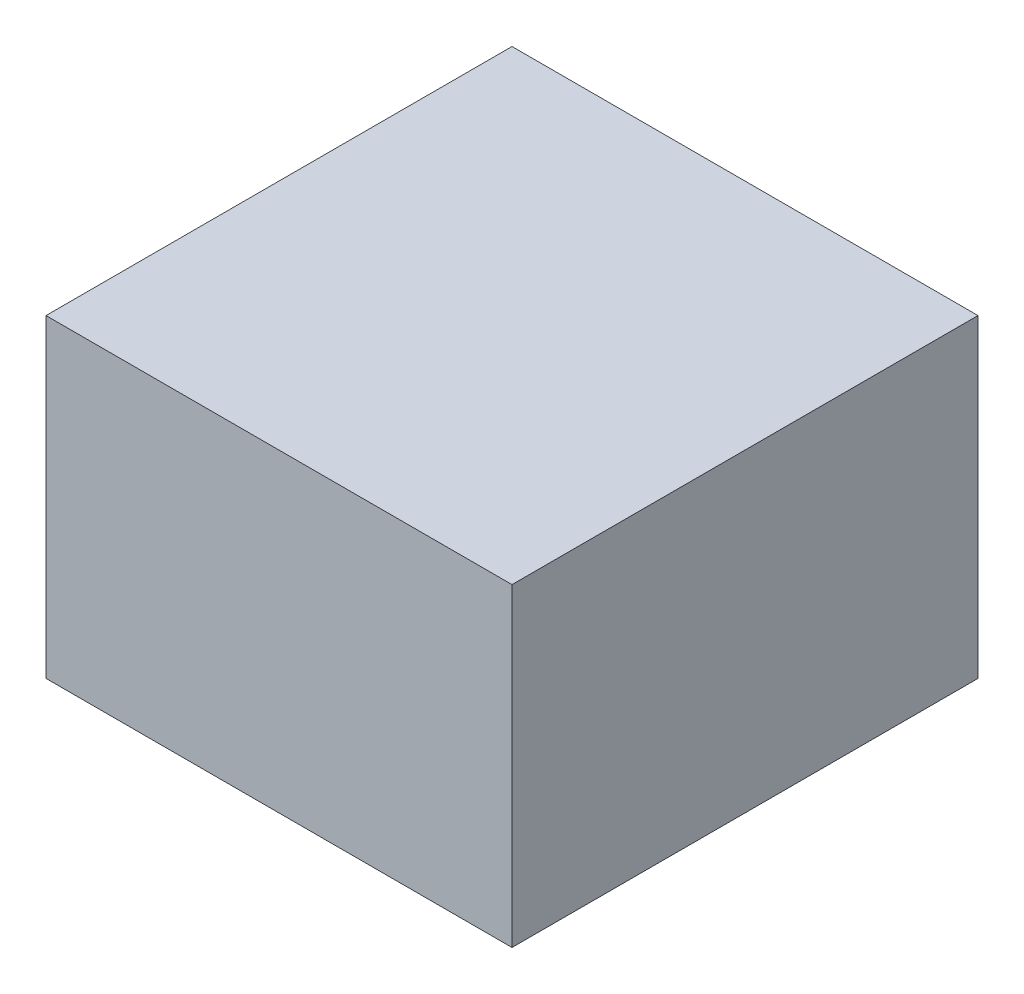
ISO-10303-21;
HEADER;
FILE_DESCRIPTION(('STEP AP214'),'2;1');
FILE_NAME('part.step','',(''),(''),'','','');
FILE_SCHEMA(('AUTOMOTIVE_DESIGN { 1 0 10303 214 1 1 1 1 }'));
ENDSEC;
DATA;
#1=APPLICATION_CONTEXT('core data for automotive mechanical design processes');
#2=APPLICATION_PROTOCOL_DEFINITION('international standard','automotive_design',2000,#1);
#3=PRODUCT_CONTEXT('',#1,'mechanical');
#4=PRODUCT('Part','Part','',(#3));
#5=PRODUCT_RELATED_PRODUCT_CATEGORY('part','',(#4));
#6=PRODUCT_DEFINITION_FORMATION('','',#4);
#7=PRODUCT_DEFINITION_CONTEXT('part definition',#1,'design');
#8=PRODUCT_DEFINITION('design','',#6,#7);
#9=PRODUCT_DEFINITION_SHAPE('','',#8);
#10=(LENGTH_UNIT() NAMED_UNIT(*) SI_UNIT(.MILLI.,.METRE.));
#11=(NAMED_UNIT(*) PLANE_ANGLE_UNIT() SI_UNIT($,.RADIAN.));
#12=(NAMED_UNIT(*) SI_UNIT($,.STERADIAN.) SOLID_ANGLE_UNIT());
#13=UNCERTAINTY_MEASURE_WITH_UNIT(LENGTH_MEASURE(1.E-05),#10,'distance_accuracy_value','');
#14=(GEOMETRIC_REPRESENTATION_CONTEXT(3) GLOBAL_UNCERTAINTY_ASSIGNED_CONTEXT((#13)) GLOBAL_UNIT_ASSIGNED_CONTEXT((#10,
#11,#12)) REPRESENTATION_CONTEXT('',''));
#15=CARTESIAN_POINT('',(0.,0.,0.));
#16=DIRECTION('',(0.,0.,1.));
#17=DIRECTION('',(1.,0.,0.));
#18=AXIS2_PLACEMENT_3D('',#15,#16,#17);
#19=CARTESIAN_POINT('',(0.,29.,0.));
#20=DIRECTION('',(1.,0.,0.));
#21=DIRECTION('',(0.,0.,-1.));
#22=AXIS2_PLACEMENT_3D('',#19,#20,#21);
#23=PLANE('',#22);
#24=DIRECTION('',(0.,0.,1.));
#25=VECTOR('',#24,1.);
#26=CARTESIAN_POINT('',(0.,0.,0.));
#27=LINE('',#26,#25);
#28=CARTESIAN_POINT('',(0.,0.,-43.));
#29=VERTEX_POINT('',#28);
#30=CARTESIAN_POINT('',(0.,0.,0.));
#31=VERTEX_POINT('',#30);
#32=EDGE_CURVE('E107',#29,#31,#27,.T.);
#33=ORIENTED_EDGE('',*,*,#32,.T.);
#34=DIRECTION('',(0.,-1.,0.));
#35=VECTOR('',#34,1.);
#36=CARTESIAN_POINT('',(0.,29.,0.));
#37=LINE('',#36,#35);
#38=CARTESIAN_POINT('',(0.,29.,0.));
#39=VERTEX_POINT('',#38);
#40=EDGE_CURVE('E11',#39,#31,#37,.T.);
#41=ORIENTED_EDGE('',*,*,#40,.F.);
#42=DIRECTION('',(0.,0.,1.));
#43=VECTOR('',#42,1.);
#44=CARTESIAN_POINT('',(0.,29.,0.));
#45=LINE('',#44,#43);
#46=CARTESIAN_POINT('',(0.,29.,-43.));
#47=VERTEX_POINT('',#46);
#48=EDGE_CURVE('E91',#47,#39,#45,.T.);
#49=ORIENTED_EDGE('',*,*,#48,.F.);
#50=DIRECTION('',(0.,-1.,0.));
#51=VECTOR('',#50,1.);
#52=CARTESIAN_POINT('',(0.,29.,-43.));
#53=LINE('',#52,#51);
#54=EDGE_CURVE('E103',#47,#29,#53,.T.);
#55=ORIENTED_EDGE('',*,*,#54,.T.);
#56=EDGE_LOOP('',(#33,#41,#49,#55));
#57=FACE_BOUND('',#56,.T.);
#58=ADVANCED_FACE('F39',(#57),#23,.F.);
#59=CARTESIAN_POINT('',(0.,29.,0.));
#60=DIRECTION('',(0.,0.,-1.));
#61=DIRECTION('',(-1.,0.,0.));
#62=AXIS2_PLACEMENT_3D('',#59,#60,#61);
#63=PLANE('',#62);
#64=DIRECTION('',(1.,0.,0.));
#65=VECTOR('',#64,1.);
#66=CARTESIAN_POINT('',(0.,0.,0.));
#67=LINE('',#66,#65);
#68=CARTESIAN_POINT('',(43.,0.,0.));
#69=VERTEX_POINT('',#68);
#70=EDGE_CURVE('E96',#31,#69,#67,.T.);
#71=ORIENTED_EDGE('',*,*,#70,.T.);
#72=DIRECTION('',(0.,-1.,0.));
#73=VECTOR('',#72,1.);
#74=CARTESIAN_POINT('',(43.,29.,0.));
#75=LINE('',#74,#73);
#76=CARTESIAN_POINT('',(43.,29.,0.));
#77=VERTEX_POINT('',#76);
#78=EDGE_CURVE('E48',#77,#69,#75,.T.);
#79=ORIENTED_EDGE('',*,*,#78,.F.);
#80=DIRECTION('',(1.,0.,0.));
#81=VECTOR('',#80,1.);
#82=CARTESIAN_POINT('',(0.,29.,0.));
#83=LINE('',#82,#81);
#84=EDGE_CURVE('E86',#39,#77,#83,.T.);
#85=ORIENTED_EDGE('',*,*,#84,.F.);
#86=ORIENTED_EDGE('',*,*,#40,.T.);
#87=EDGE_LOOP('',(#71,#79,#85,#86));
#88=FACE_BOUND('',#87,.T.);
#89=ADVANCED_FACE('F95',(#88),#63,.F.);
#90=CARTESIAN_POINT('',(43.,29.,0.));
#91=DIRECTION('',(-1.,0.,0.));
#92=DIRECTION('',(0.,0.,1.));
#93=AXIS2_PLACEMENT_3D('',#90,#91,#92);
#94=PLANE('',#93);
#95=DIRECTION('',(0.,0.,-1.));
#96=VECTOR('',#95,1.);
#97=CARTESIAN_POINT('',(43.,0.,0.));
#98=LINE('',#97,#96);
#99=CARTESIAN_POINT('',(43.,0.,-43.));
#100=VERTEX_POINT('',#99);
#101=EDGE_CURVE('E73',#69,#100,#98,.T.);
#102=ORIENTED_EDGE('',*,*,#101,.T.);
#103=DIRECTION('',(0.,-1.,0.));
#104=VECTOR('',#103,1.);
#105=CARTESIAN_POINT('',(43.,29.,-43.));
#106=LINE('',#105,#104);
#107=CARTESIAN_POINT('',(43.,29.,-43.));
#108=VERTEX_POINT('',#107);
#109=EDGE_CURVE('E98',#108,#100,#106,.T.);
#110=ORIENTED_EDGE('',*,*,#109,.F.);
#111=DIRECTION('',(0.,0.,-1.));
#112=VECTOR('',#111,1.);
#113=CARTESIAN_POINT('',(43.,29.,0.));
#114=LINE('',#113,#112);
#115=EDGE_CURVE('E89',#77,#108,#114,.T.);
#116=ORIENTED_EDGE('',*,*,#115,.F.);
#117=ORIENTED_EDGE('',*,*,#78,.T.);
#118=EDGE_LOOP('',(#102,#110,#116,#117));
#119=FACE_BOUND('',#118,.T.);
#120=ADVANCED_FACE('F99',(#119),#94,.F.);
#121=CARTESIAN_POINT('',(0.,29.,-43.));
#122=DIRECTION('',(0.,0.,1.));
#123=DIRECTION('',(1.,0.,0.));
#124=AXIS2_PLACEMENT_3D('',#121,#122,#123);
#125=PLANE('',#124);
#126=DIRECTION('',(-1.,0.,0.));
#127=VECTOR('',#126,1.);
#128=CARTESIAN_POINT('',(0.,0.,-43.));
#129=LINE('',#128,#127);
#130=EDGE_CURVE('E79',#100,#29,#129,.T.);
#131=ORIENTED_EDGE('',*,*,#130,.T.);
#132=ORIENTED_EDGE('',*,*,#54,.F.);
#133=DIRECTION('',(-1.,0.,0.));
#134=VECTOR('',#133,1.);
#135=CARTESIAN_POINT('',(0.,29.,-43.));
#136=LINE('',#135,#134);
#137=EDGE_CURVE('E56',#108,#47,#136,.T.);
#138=ORIENTED_EDGE('',*,*,#137,.F.);
#139=ORIENTED_EDGE('',*,*,#109,.T.);
#140=EDGE_LOOP('',(#131,#132,#138,#139));
#141=FACE_BOUND('',#140,.T.);
#142=ADVANCED_FACE('F120',(#141),#125,.F.);
#143=CARTESIAN_POINT('',(0.,29.,0.));
#144=DIRECTION('',(0.,-1.,0.));
#145=DIRECTION('',(0.,0.,-1.));
#146=AXIS2_PLACEMENT_3D('',#143,#144,#145);
#147=PLANE('',#146);
#148=ORIENTED_EDGE('',*,*,#48,.T.);
#149=ORIENTED_EDGE('',*,*,#84,.T.);
#150=ORIENTED_EDGE('',*,*,#115,.T.);
#151=ORIENTED_EDGE('',*,*,#137,.T.);
#152=EDGE_LOOP('',(#148,#149,#150,#151));
#153=FACE_BOUND('',#152,.T.);
#154=ADVANCED_FACE('F87',(#153),#147,.F.);
#155=CARTESIAN_POINT('',(0.,0.,0.));
#156=DIRECTION('',(0.,-1.,0.));
#157=DIRECTION('',(0.,0.,-1.));
#158=AXIS2_PLACEMENT_3D('',#155,#156,#157);
#159=PLANE('',#158);
#160=ORIENTED_EDGE('',*,*,#32,.F.);
#161=ORIENTED_EDGE('',*,*,#130,.F.);
#162=ORIENTED_EDGE('',*,*,#101,.F.);
#163=ORIENTED_EDGE('',*,*,#70,.F.);
#164=EDGE_LOOP('',(#160,#161,#162,#163));
#165=FACE_BOUND('',#164,.T.);
#166=ADVANCED_FACE('F123',(#165),#159,.T.);
#167=CLOSED_SHELL('',(#58,#89,#120,#142,#154,#166));
#168=MANIFOLD_SOLID_BREP('B2',#167);
#169=ADVANCED_BREP_SHAPE_REPRESENTATION('',(#18,#168),#14);
#170=SHAPE_DEFINITION_REPRESENTATION(#9,#169);
ENDSEC;
END-ISO-10303-21;
